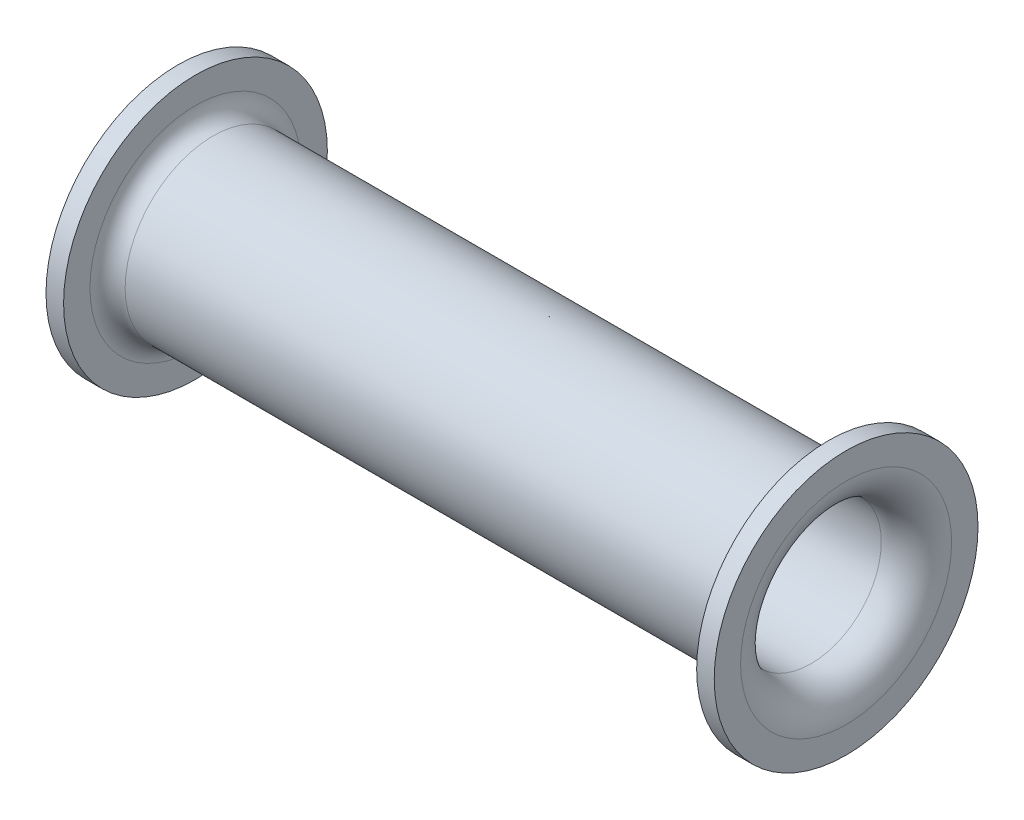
ISO-10303-21;
HEADER;
FILE_DESCRIPTION(('STEP AP214'),'2;1');
FILE_NAME('part.step','',(''),(''),'','','');
FILE_SCHEMA(('AUTOMOTIVE_DESIGN { 1 0 10303 214 1 1 1 1 }'));
ENDSEC;
DATA;
#1=APPLICATION_CONTEXT('core data for automotive mechanical design processes');
#2=APPLICATION_PROTOCOL_DEFINITION('international standard','automotive_design',2000,#1);
#3=PRODUCT_CONTEXT('',#1,'mechanical');
#4=PRODUCT('Part','Part','',(#3));
#5=PRODUCT_RELATED_PRODUCT_CATEGORY('part','',(#4));
#6=PRODUCT_DEFINITION_FORMATION('','',#4);
#7=PRODUCT_DEFINITION_CONTEXT('part definition',#1,'design');
#8=PRODUCT_DEFINITION('design','',#6,#7);
#9=PRODUCT_DEFINITION_SHAPE('','',#8);
#10=(LENGTH_UNIT() NAMED_UNIT(*) SI_UNIT(.MILLI.,.METRE.));
#11=(NAMED_UNIT(*) PLANE_ANGLE_UNIT() SI_UNIT($,.RADIAN.));
#12=(NAMED_UNIT(*) SI_UNIT($,.STERADIAN.) SOLID_ANGLE_UNIT());
#13=UNCERTAINTY_MEASURE_WITH_UNIT(LENGTH_MEASURE(1.E-05),#10,'distance_accuracy_value','');
#14=(GEOMETRIC_REPRESENTATION_CONTEXT(3) GLOBAL_UNCERTAINTY_ASSIGNED_CONTEXT((#13)) GLOBAL_UNIT_ASSIGNED_CONTEXT((#10,
#11,#12)) REPRESENTATION_CONTEXT('',''));
#15=CARTESIAN_POINT('',(0.,0.,0.));
#16=DIRECTION('',(0.,0.,1.));
#17=DIRECTION('',(1.,0.,0.));
#18=AXIS2_PLACEMENT_3D('',#15,#16,#17);
#19=CARTESIAN_POINT('',(-20.,0.,0.));
#20=DIRECTION('',(-1.,0.,0.));
#21=DIRECTION('',(0.,0.,1.));
#22=AXIS2_PLACEMENT_3D('',#19,#20,#21);
#23=CYLINDRICAL_SURFACE('',#22,5.);
#24=CARTESIAN_POINT('',(-17.,0.,0.));
#25=DIRECTION('',(-1.,0.,0.));
#26=DIRECTION('',(0.,0.,1.));
#27=AXIS2_PLACEMENT_3D('',#24,#25,#26);
#28=CIRCLE('',#27,5.);
#29=CARTESIAN_POINT('',(-17.,0.,5.));
#30=VERTEX_POINT('',#29);
#31=EDGE_CURVE('E10',#30,#30,#28,.T.);
#32=ORIENTED_EDGE('',*,*,#31,.F.);
#33=EDGE_LOOP('',(#32));
#34=FACE_BOUND('',#33,.T.);
#35=CARTESIAN_POINT('',(17.,0.,0.));
#36=DIRECTION('',(1.,0.,0.));
#37=DIRECTION('',(0.,0.,-1.));
#38=AXIS2_PLACEMENT_3D('',#35,#36,#37);
#39=CIRCLE('',#38,5.);
#40=CARTESIAN_POINT('',(17.,0.,-5.));
#41=VERTEX_POINT('',#40);
#42=EDGE_CURVE('E43',#41,#41,#39,.T.);
#43=ORIENTED_EDGE('',*,*,#42,.F.);
#44=EDGE_LOOP('',(#43));
#45=FACE_BOUND('',#44,.T.);
#46=ADVANCED_FACE('F31',(#34,#45),#23,.T.);
#47=CARTESIAN_POINT('',(-20.,0.,0.));
#48=DIRECTION('',(-1.,0.,0.));
#49=DIRECTION('',(0.,0.,1.));
#50=AXIS2_PLACEMENT_3D('',#47,#48,#49);
#51=CYLINDRICAL_SURFACE('',#50,4.);
#52=CARTESIAN_POINT('',(-17.,0.,0.));
#53=DIRECTION('',(-1.,0.,0.));
#54=DIRECTION('',(0.,0.,1.));
#55=AXIS2_PLACEMENT_3D('',#52,#53,#54);
#56=CIRCLE('',#55,4.);
#57=CARTESIAN_POINT('',(-17.,0.,4.));
#58=VERTEX_POINT('',#57);
#59=EDGE_CURVE('E38',#58,#58,#56,.F.);
#60=ORIENTED_EDGE('',*,*,#59,.F.);
#61=EDGE_LOOP('',(#60));
#62=FACE_BOUND('',#61,.T.);
#63=CARTESIAN_POINT('',(17.,0.,0.));
#64=DIRECTION('',(1.,0.,0.));
#65=DIRECTION('',(0.,0.,-1.));
#66=AXIS2_PLACEMENT_3D('',#63,#64,#65);
#67=CIRCLE('',#66,4.);
#68=CARTESIAN_POINT('',(17.,0.,-4.));
#69=VERTEX_POINT('',#68);
#70=EDGE_CURVE('E34',#69,#69,#67,.F.);
#71=ORIENTED_EDGE('',*,*,#70,.F.);
#72=EDGE_LOOP('',(#71));
#73=FACE_BOUND('',#72,.T.);
#74=ADVANCED_FACE('F100',(#62,#73),#51,.F.);
#75=CARTESIAN_POINT('',(-17.,0.,0.));
#76=DIRECTION('',(-1.,0.,0.));
#77=DIRECTION('',(0.,0.,1.));
#78=AXIS2_PLACEMENT_3D('',#75,#76,#77);
#79=TOROIDAL_SURFACE('',#78,6.,2.);
#80=ORIENTED_EDGE('',*,*,#59,.T.);
#81=EDGE_LOOP('',(#80));
#82=FACE_BOUND('',#81,.T.);
#83=CARTESIAN_POINT('',(-19.,0.,0.));
#84=DIRECTION('',(-1.,0.,0.));
#85=DIRECTION('',(0.,0.,1.));
#86=AXIS2_PLACEMENT_3D('',#83,#84,#85);
#87=CIRCLE('',#86,6.);
#88=CARTESIAN_POINT('',(-19.,0.,6.));
#89=VERTEX_POINT('',#88);
#90=EDGE_CURVE('E56',#89,#89,#87,.T.);
#91=ORIENTED_EDGE('',*,*,#90,.T.);
#92=EDGE_LOOP('',(#91));
#93=FACE_BOUND('',#92,.T.);
#94=ADVANCED_FACE('F102',(#82,#93),#79,.T.);
#95=CARTESIAN_POINT('',(-17.,0.,0.));
#96=DIRECTION('',(-1.,0.,0.));
#97=DIRECTION('',(0.,0.,1.));
#98=AXIS2_PLACEMENT_3D('',#95,#96,#97);
#99=TOROIDAL_SURFACE('',#98,6.,1.);
#100=CARTESIAN_POINT('',(-18.,0.,0.));
#101=DIRECTION('',(-1.,0.,0.));
#102=DIRECTION('',(0.,0.,1.));
#103=AXIS2_PLACEMENT_3D('',#100,#101,#102);
#104=CIRCLE('',#103,6.);
#105=CARTESIAN_POINT('',(-18.,0.,6.));
#106=VERTEX_POINT('',#105);
#107=EDGE_CURVE('E47',#106,#106,#104,.T.);
#108=ORIENTED_EDGE('',*,*,#107,.F.);
#109=EDGE_LOOP('',(#108));
#110=FACE_BOUND('',#109,.T.);
#111=ORIENTED_EDGE('',*,*,#31,.T.);
#112=EDGE_LOOP('',(#111));
#113=FACE_BOUND('',#112,.T.);
#114=ADVANCED_FACE('F108',(#110,#113),#99,.F.);
#115=CARTESIAN_POINT('',(-18.,7.5,0.));
#116=DIRECTION('',(-1.,0.,0.));
#117=DIRECTION('',(0.,0.,1.));
#118=AXIS2_PLACEMENT_3D('',#115,#116,#117);
#119=PLANE('',#118);
#120=CARTESIAN_POINT('',(-18.,0.,0.));
#121=DIRECTION('',(-1.,0.,0.));
#122=DIRECTION('',(0.,0.,1.));
#123=AXIS2_PLACEMENT_3D('',#120,#121,#122);
#124=CIRCLE('',#123,7.5);
#125=CARTESIAN_POINT('',(-18.,0.,7.5));
#126=VERTEX_POINT('',#125);
#127=EDGE_CURVE('E50',#126,#126,#124,.T.);
#128=ORIENTED_EDGE('',*,*,#127,.F.);
#129=EDGE_LOOP('',(#128));
#130=FACE_BOUND('',#129,.T.);
#131=ORIENTED_EDGE('',*,*,#107,.T.);
#132=EDGE_LOOP('',(#131));
#133=FACE_BOUND('',#132,.T.);
#134=ADVANCED_FACE('F116',(#130,#133),#119,.F.);
#135=CARTESIAN_POINT('',(-20.,0.,0.));
#136=DIRECTION('',(-1.,0.,0.));
#137=DIRECTION('',(0.,0.,1.));
#138=AXIS2_PLACEMENT_3D('',#135,#136,#137);
#139=CYLINDRICAL_SURFACE('',#138,7.5);
#140=CARTESIAN_POINT('',(-19.,0.,0.));
#141=DIRECTION('',(-1.,0.,0.));
#142=DIRECTION('',(0.,0.,1.));
#143=AXIS2_PLACEMENT_3D('',#140,#141,#142);
#144=CIRCLE('',#143,7.5);
#145=CARTESIAN_POINT('',(-19.,0.,7.5));
#146=VERTEX_POINT('',#145);
#147=EDGE_CURVE('E53',#146,#146,#144,.T.);
#148=ORIENTED_EDGE('',*,*,#147,.F.);
#149=EDGE_LOOP('',(#148));
#150=FACE_BOUND('',#149,.T.);
#151=ORIENTED_EDGE('',*,*,#127,.T.);
#152=EDGE_LOOP('',(#151));
#153=FACE_BOUND('',#152,.T.);
#154=ADVANCED_FACE('F120',(#150,#153),#139,.T.);
#155=CARTESIAN_POINT('',(-19.,6.,0.));
#156=DIRECTION('',(1.,0.,0.));
#157=DIRECTION('',(0.,0.,-1.));
#158=AXIS2_PLACEMENT_3D('',#155,#156,#157);
#159=PLANE('',#158);
#160=ORIENTED_EDGE('',*,*,#90,.F.);
#161=EDGE_LOOP('',(#160));
#162=FACE_BOUND('',#161,.T.);
#163=ORIENTED_EDGE('',*,*,#147,.T.);
#164=EDGE_LOOP('',(#163));
#165=FACE_BOUND('',#164,.T.);
#166=ADVANCED_FACE('F95',(#162,#165),#159,.F.);
#167=CARTESIAN_POINT('',(17.,0.,0.));
#168=DIRECTION('',(-1.,0.,0.));
#169=DIRECTION('',(0.,0.,1.));
#170=AXIS2_PLACEMENT_3D('',#167,#168,#169);
#171=TOROIDAL_SURFACE('',#170,6.00000000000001,1.99999999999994);
#172=CARTESIAN_POINT('',(18.9999999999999,0.,0.));
#173=DIRECTION('',(-1.,0.,0.));
#174=DIRECTION('',(0.,0.,1.));
#175=AXIS2_PLACEMENT_3D('',#172,#173,#174);
#176=CIRCLE('',#175,6.00000000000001);
#177=CARTESIAN_POINT('',(18.9999999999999,0.,6.00000000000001));
#178=VERTEX_POINT('',#177);
#179=EDGE_CURVE('E59',#178,#178,#176,.T.);
#180=ORIENTED_EDGE('',*,*,#179,.F.);
#181=EDGE_LOOP('',(#180));
#182=FACE_BOUND('',#181,.T.);
#183=ORIENTED_EDGE('',*,*,#70,.T.);
#184=EDGE_LOOP('',(#183));
#185=FACE_BOUND('',#184,.T.);
#186=ADVANCED_FACE('F89',(#182,#185),#171,.T.);
#187=CARTESIAN_POINT('',(18.9999999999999,6.00000000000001,0.));
#188=DIRECTION('',(-1.,0.,0.));
#189=DIRECTION('',(0.,0.,1.));
#190=AXIS2_PLACEMENT_3D('',#187,#188,#189);
#191=PLANE('',#190);
#192=CARTESIAN_POINT('',(18.9999999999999,0.,0.));
#193=DIRECTION('',(-1.,0.,0.));
#194=DIRECTION('',(0.,0.,1.));
#195=AXIS2_PLACEMENT_3D('',#192,#193,#194);
#196=CIRCLE('',#195,7.5);
#197=CARTESIAN_POINT('',(18.9999999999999,0.,7.5));
#198=VERTEX_POINT('',#197);
#199=EDGE_CURVE('E62',#198,#198,#196,.T.);
#200=ORIENTED_EDGE('',*,*,#199,.F.);
#201=EDGE_LOOP('',(#200));
#202=FACE_BOUND('',#201,.T.);
#203=ORIENTED_EDGE('',*,*,#179,.T.);
#204=EDGE_LOOP('',(#203));
#205=FACE_BOUND('',#204,.T.);
#206=ADVANCED_FACE('F83',(#202,#205),#191,.F.);
#207=CARTESIAN_POINT('',(-20.,0.,0.));
#208=DIRECTION('',(-1.,0.,0.));
#209=DIRECTION('',(0.,0.,1.));
#210=AXIS2_PLACEMENT_3D('',#207,#208,#209);
#211=CYLINDRICAL_SURFACE('',#210,7.5);
#212=CARTESIAN_POINT('',(18.,0.,0.));
#213=DIRECTION('',(-1.,0.,0.));
#214=DIRECTION('',(0.,0.,1.));
#215=AXIS2_PLACEMENT_3D('',#212,#213,#214);
#216=CIRCLE('',#215,7.5);
#217=CARTESIAN_POINT('',(18.,0.,7.5));
#218=VERTEX_POINT('',#217);
#219=EDGE_CURVE('E65',#218,#218,#216,.T.);
#220=ORIENTED_EDGE('',*,*,#219,.F.);
#221=EDGE_LOOP('',(#220));
#222=FACE_BOUND('',#221,.T.);
#223=ORIENTED_EDGE('',*,*,#199,.T.);
#224=EDGE_LOOP('',(#223));
#225=FACE_BOUND('',#224,.T.);
#226=ADVANCED_FACE('F77',(#222,#225),#211,.T.);
#227=CARTESIAN_POINT('',(18.,7.5,0.));
#228=DIRECTION('',(1.,0.,0.));
#229=DIRECTION('',(0.,0.,-1.));
#230=AXIS2_PLACEMENT_3D('',#227,#228,#229);
#231=PLANE('',#230);
#232=CARTESIAN_POINT('',(18.,0.,0.));
#233=DIRECTION('',(-1.,0.,0.));
#234=DIRECTION('',(0.,0.,1.));
#235=AXIS2_PLACEMENT_3D('',#232,#233,#234);
#236=CIRCLE('',#235,6.00000000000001);
#237=CARTESIAN_POINT('',(18.,0.,6.00000000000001));
#238=VERTEX_POINT('',#237);
#239=EDGE_CURVE('E68',#238,#238,#236,.T.);
#240=ORIENTED_EDGE('',*,*,#239,.F.);
#241=EDGE_LOOP('',(#240));
#242=FACE_BOUND('',#241,.T.);
#243=ORIENTED_EDGE('',*,*,#219,.T.);
#244=EDGE_LOOP('',(#243));
#245=FACE_BOUND('',#244,.T.);
#246=ADVANCED_FACE('F74',(#242,#245),#231,.F.);
#247=CARTESIAN_POINT('',(17.,0.,0.));
#248=DIRECTION('',(-1.,0.,0.));
#249=DIRECTION('',(0.,0.,1.));
#250=AXIS2_PLACEMENT_3D('',#247,#248,#249);
#251=TOROIDAL_SURFACE('',#250,6.00000000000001,1.00000000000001);
#252=ORIENTED_EDGE('',*,*,#42,.T.);
#253=EDGE_LOOP('',(#252));
#254=FACE_BOUND('',#253,.T.);
#255=ORIENTED_EDGE('',*,*,#239,.T.);
#256=EDGE_LOOP('',(#255));
#257=FACE_BOUND('',#256,.T.);
#258=ADVANCED_FACE('F72',(#254,#257),#251,.F.);
#259=CLOSED_SHELL('',(#46,#74,#94,#114,#134,#154,#166,#186,#206,#226,#246,#258));
#260=MANIFOLD_SOLID_BREP('B2',#259);
#261=ADVANCED_BREP_SHAPE_REPRESENTATION('',(#18,#260),#14);
#262=SHAPE_DEFINITION_REPRESENTATION(#9,#261);
ENDSEC;
END-ISO-10303-21;
